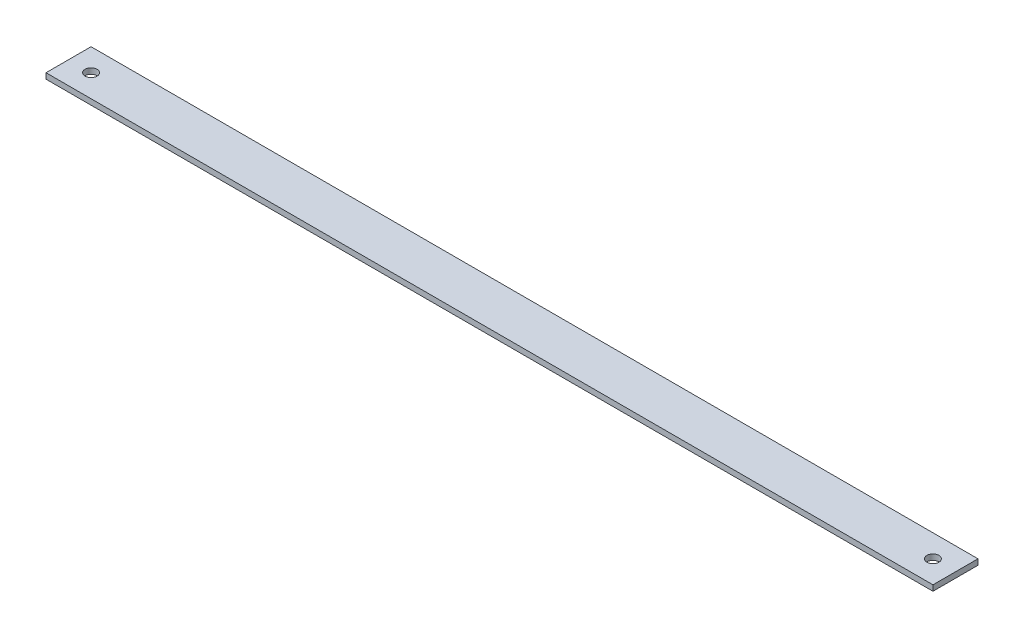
ISO-10303-21;
HEADER;
FILE_DESCRIPTION(('STEP AP214'),'2;1');
FILE_NAME('part.step','',(''),(''),'','','');
FILE_SCHEMA(('AUTOMOTIVE_DESIGN { 1 0 10303 214 1 1 1 1 }'));
ENDSEC;
DATA;
#1=APPLICATION_CONTEXT('core data for automotive mechanical design processes');
#2=APPLICATION_PROTOCOL_DEFINITION('international standard','automotive_design',2000,#1);
#3=PRODUCT_CONTEXT('',#1,'mechanical');
#4=PRODUCT('Part','Part','',(#3));
#5=PRODUCT_RELATED_PRODUCT_CATEGORY('part','',(#4));
#6=PRODUCT_DEFINITION_FORMATION('','',#4);
#7=PRODUCT_DEFINITION_CONTEXT('part definition',#1,'design');
#8=PRODUCT_DEFINITION('design','',#6,#7);
#9=PRODUCT_DEFINITION_SHAPE('','',#8);
#10=(LENGTH_UNIT() NAMED_UNIT(*) SI_UNIT(.MILLI.,.METRE.));
#11=(NAMED_UNIT(*) PLANE_ANGLE_UNIT() SI_UNIT($,.RADIAN.));
#12=(NAMED_UNIT(*) SI_UNIT($,.STERADIAN.) SOLID_ANGLE_UNIT());
#13=UNCERTAINTY_MEASURE_WITH_UNIT(LENGTH_MEASURE(1.E-05),#10,'distance_accuracy_value','');
#14=(GEOMETRIC_REPRESENTATION_CONTEXT(3) GLOBAL_UNCERTAINTY_ASSIGNED_CONTEXT((#13)) GLOBAL_UNIT_ASSIGNED_CONTEXT((#10,
#11,#12)) REPRESENTATION_CONTEXT('',''));
#15=CARTESIAN_POINT('',(0.,0.,0.));
#16=DIRECTION('',(0.,0.,1.));
#17=DIRECTION('',(1.,0.,0.));
#18=AXIS2_PLACEMENT_3D('',#15,#16,#17);
#19=CARTESIAN_POINT('',(250.063,3.175,-12.7));
#20=DIRECTION('',(-1.,0.,0.));
#21=DIRECTION('',(0.,0.,1.));
#22=AXIS2_PLACEMENT_3D('',#19,#20,#21);
#23=PLANE('',#22);
#24=DIRECTION('',(0.,0.,-1.));
#25=VECTOR('',#24,1.);
#26=CARTESIAN_POINT('',(250.063,0.,-12.7));
#27=LINE('',#26,#25);
#28=CARTESIAN_POINT('',(250.063,0.,12.7));
#29=VERTEX_POINT('',#28);
#30=CARTESIAN_POINT('',(250.063,0.,-12.7));
#31=VERTEX_POINT('',#30);
#32=EDGE_CURVE('E97',#29,#31,#27,.T.);
#33=ORIENTED_EDGE('',*,*,#32,.T.);
#34=DIRECTION('',(0.,-1.,0.));
#35=VECTOR('',#34,1.);
#36=CARTESIAN_POINT('',(250.063,3.175,-12.7));
#37=LINE('',#36,#35);
#38=CARTESIAN_POINT('',(250.063,3.175,-12.7));
#39=VERTEX_POINT('',#38);
#40=EDGE_CURVE('E11',#39,#31,#37,.T.);
#41=ORIENTED_EDGE('',*,*,#40,.F.);
#42=DIRECTION('',(0.,0.,-1.));
#43=VECTOR('',#42,1.);
#44=CARTESIAN_POINT('',(250.063,3.175,-12.7));
#45=LINE('',#44,#43);
#46=CARTESIAN_POINT('',(250.063,3.175,12.7));
#47=VERTEX_POINT('',#46);
#48=EDGE_CURVE('E85',#47,#39,#45,.T.);
#49=ORIENTED_EDGE('',*,*,#48,.F.);
#50=DIRECTION('',(0.,-1.,0.));
#51=VECTOR('',#50,1.);
#52=CARTESIAN_POINT('',(250.063,3.175,12.7));
#53=LINE('',#52,#51);
#54=EDGE_CURVE('E93',#47,#29,#53,.T.);
#55=ORIENTED_EDGE('',*,*,#54,.T.);
#56=EDGE_LOOP('',(#33,#41,#49,#55));
#57=FACE_BOUND('',#56,.T.);
#58=ADVANCED_FACE('F34',(#57),#23,.F.);
#59=CARTESIAN_POINT('',(-250.063,3.175,-12.7));
#60=DIRECTION('',(0.,0.,1.));
#61=DIRECTION('',(1.,0.,0.));
#62=AXIS2_PLACEMENT_3D('',#59,#60,#61);
#63=PLANE('',#62);
#64=DIRECTION('',(-1.,0.,0.));
#65=VECTOR('',#64,1.);
#66=CARTESIAN_POINT('',(-250.063,0.,-12.7));
#67=LINE('',#66,#65);
#68=CARTESIAN_POINT('',(-250.063,0.,-12.7));
#69=VERTEX_POINT('',#68);
#70=EDGE_CURVE('E89',#31,#69,#67,.T.);
#71=ORIENTED_EDGE('',*,*,#70,.T.);
#72=DIRECTION('',(0.,-1.,0.));
#73=VECTOR('',#72,1.);
#74=CARTESIAN_POINT('',(-250.063,3.175,-12.7));
#75=LINE('',#74,#73);
#76=CARTESIAN_POINT('',(-250.063,3.175,-12.7));
#77=VERTEX_POINT('',#76);
#78=EDGE_CURVE('E42',#77,#69,#75,.T.);
#79=ORIENTED_EDGE('',*,*,#78,.F.);
#80=DIRECTION('',(-1.,0.,0.));
#81=VECTOR('',#80,1.);
#82=CARTESIAN_POINT('',(-250.063,3.175,-12.7));
#83=LINE('',#82,#81);
#84=EDGE_CURVE('E80',#39,#77,#83,.T.);
#85=ORIENTED_EDGE('',*,*,#84,.F.);
#86=ORIENTED_EDGE('',*,*,#40,.T.);
#87=EDGE_LOOP('',(#71,#79,#85,#86));
#88=FACE_BOUND('',#87,.T.);
#89=ADVANCED_FACE('F88',(#88),#63,.F.);
#90=CARTESIAN_POINT('',(-250.063,3.175,-12.7));
#91=DIRECTION('',(1.,0.,0.));
#92=DIRECTION('',(0.,0.,-1.));
#93=AXIS2_PLACEMENT_3D('',#90,#91,#92);
#94=PLANE('',#93);
#95=DIRECTION('',(0.,0.,1.));
#96=VECTOR('',#95,1.);
#97=CARTESIAN_POINT('',(-250.063,0.,-12.7));
#98=LINE('',#97,#96);
#99=CARTESIAN_POINT('',(-250.063,0.,12.7));
#100=VERTEX_POINT('',#99);
#101=EDGE_CURVE('E67',#69,#100,#98,.T.);
#102=ORIENTED_EDGE('',*,*,#101,.T.);
#103=DIRECTION('',(0.,-1.,0.));
#104=VECTOR('',#103,1.);
#105=CARTESIAN_POINT('',(-250.063,3.175,12.7));
#106=LINE('',#105,#104);
#107=CARTESIAN_POINT('',(-250.063,3.175,12.7));
#108=VERTEX_POINT('',#107);
#109=EDGE_CURVE('E90',#108,#100,#106,.T.);
#110=ORIENTED_EDGE('',*,*,#109,.F.);
#111=DIRECTION('',(0.,0.,1.));
#112=VECTOR('',#111,1.);
#113=CARTESIAN_POINT('',(-250.063,3.175,-12.7));
#114=LINE('',#113,#112);
#115=EDGE_CURVE('E83',#77,#108,#114,.T.);
#116=ORIENTED_EDGE('',*,*,#115,.F.);
#117=ORIENTED_EDGE('',*,*,#78,.T.);
#118=EDGE_LOOP('',(#102,#110,#116,#117));
#119=FACE_BOUND('',#118,.T.);
#120=ADVANCED_FACE('F91',(#119),#94,.F.);
#121=CARTESIAN_POINT('',(-250.063,3.175,12.7));
#122=DIRECTION('',(0.,0.,-1.));
#123=DIRECTION('',(-1.,0.,0.));
#124=AXIS2_PLACEMENT_3D('',#121,#122,#123);
#125=PLANE('',#124);
#126=DIRECTION('',(1.,0.,0.));
#127=VECTOR('',#126,1.);
#128=CARTESIAN_POINT('',(-250.063,0.,12.7));
#129=LINE('',#128,#127);
#130=EDGE_CURVE('E73',#100,#29,#129,.T.);
#131=ORIENTED_EDGE('',*,*,#130,.T.);
#132=ORIENTED_EDGE('',*,*,#54,.F.);
#133=DIRECTION('',(1.,0.,0.));
#134=VECTOR('',#133,1.);
#135=CARTESIAN_POINT('',(-250.063,3.175,12.7));
#136=LINE('',#135,#134);
#137=EDGE_CURVE('E50',#108,#47,#136,.T.);
#138=ORIENTED_EDGE('',*,*,#137,.F.);
#139=ORIENTED_EDGE('',*,*,#109,.T.);
#140=EDGE_LOOP('',(#131,#132,#138,#139));
#141=FACE_BOUND('',#140,.T.);
#142=ADVANCED_FACE('F105',(#141),#125,.F.);
#143=CARTESIAN_POINT('',(250.063,3.175,12.7));
#144=DIRECTION('',(0.,1.,0.));
#145=DIRECTION('',(0.,0.,1.));
#146=AXIS2_PLACEMENT_3D('',#143,#144,#145);
#147=PLANE('',#146);
#148=CARTESIAN_POINT('',(237.363,3.175,0.));
#149=DIRECTION('',(0.,1.,0.));
#150=DIRECTION('',(0.,0.,1.));
#151=AXIS2_PLACEMENT_3D('',#148,#149,#150);
#152=CIRCLE('',#151,3.37819999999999);
#153=CARTESIAN_POINT('',(237.363,3.175,3.37819999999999));
#154=VERTEX_POINT('',#153);
#155=EDGE_CURVE('E117',#154,#154,#152,.T.);
#156=ORIENTED_EDGE('',*,*,#155,.F.);
#157=EDGE_LOOP('',(#156));
#158=FACE_BOUND('',#157,.T.);
#159=CARTESIAN_POINT('',(-237.363,3.175,0.));
#160=DIRECTION('',(0.,1.,0.));
#161=DIRECTION('',(0.,0.,1.));
#162=AXIS2_PLACEMENT_3D('',#159,#160,#161);
#163=CIRCLE('',#162,3.37819999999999);
#164=CARTESIAN_POINT('',(-237.363,3.175,3.37819999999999));
#165=VERTEX_POINT('',#164);
#166=EDGE_CURVE('E111',#165,#165,#163,.T.);
#167=ORIENTED_EDGE('',*,*,#166,.F.);
#168=EDGE_LOOP('',(#167));
#169=FACE_BOUND('',#168,.T.);
#170=ORIENTED_EDGE('',*,*,#48,.T.);
#171=ORIENTED_EDGE('',*,*,#84,.T.);
#172=ORIENTED_EDGE('',*,*,#115,.T.);
#173=ORIENTED_EDGE('',*,*,#137,.T.);
#174=EDGE_LOOP('',(#170,#171,#172,#173));
#175=FACE_BOUND('',#174,.T.);
#176=ADVANCED_FACE('F81',(#158,#169,#175),#147,.T.);
#177=CARTESIAN_POINT('',(250.063,0.,12.7));
#178=DIRECTION('',(0.,1.,0.));
#179=DIRECTION('',(0.,0.,1.));
#180=AXIS2_PLACEMENT_3D('',#177,#178,#179);
#181=PLANE('',#180);
#182=CARTESIAN_POINT('',(237.363,0.,0.));
#183=DIRECTION('',(0.,1.,0.));
#184=DIRECTION('',(0.,0.,1.));
#185=AXIS2_PLACEMENT_3D('',#182,#183,#184);
#186=CIRCLE('',#185,3.37819999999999);
#187=CARTESIAN_POINT('',(237.363,0.,3.37819999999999));
#188=VERTEX_POINT('',#187);
#189=EDGE_CURVE('E114',#188,#188,#186,.T.);
#190=ORIENTED_EDGE('',*,*,#189,.T.);
#191=EDGE_LOOP('',(#190));
#192=FACE_BOUND('',#191,.T.);
#193=CARTESIAN_POINT('',(-237.363,0.,0.));
#194=DIRECTION('',(0.,1.,0.));
#195=DIRECTION('',(0.,0.,1.));
#196=AXIS2_PLACEMENT_3D('',#193,#194,#195);
#197=CIRCLE('',#196,3.37819999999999);
#198=CARTESIAN_POINT('',(-237.363,0.,3.37819999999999));
#199=VERTEX_POINT('',#198);
#200=EDGE_CURVE('E100',#199,#199,#197,.T.);
#201=ORIENTED_EDGE('',*,*,#200,.T.);
#202=EDGE_LOOP('',(#201));
#203=FACE_BOUND('',#202,.T.);
#204=ORIENTED_EDGE('',*,*,#32,.F.);
#205=ORIENTED_EDGE('',*,*,#130,.F.);
#206=ORIENTED_EDGE('',*,*,#101,.F.);
#207=ORIENTED_EDGE('',*,*,#70,.F.);
#208=EDGE_LOOP('',(#204,#205,#206,#207));
#209=FACE_BOUND('',#208,.T.);
#210=ADVANCED_FACE('F108',(#192,#203,#209),#181,.F.);
#211=CARTESIAN_POINT('',(-237.363,0.,0.));
#212=DIRECTION('',(0.,1.,0.));
#213=DIRECTION('',(0.,0.,1.));
#214=AXIS2_PLACEMENT_3D('',#211,#212,#213);
#215=CYLINDRICAL_SURFACE('',#214,3.37819999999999);
#216=ORIENTED_EDGE('',*,*,#200,.F.);
#217=EDGE_LOOP('',(#216));
#218=FACE_BOUND('',#217,.T.);
#219=ORIENTED_EDGE('',*,*,#166,.T.);
#220=EDGE_LOOP('',(#219));
#221=FACE_BOUND('',#220,.T.);
#222=ADVANCED_FACE('F128',(#218,#221),#215,.F.);
#223=CARTESIAN_POINT('',(237.363,0.,0.));
#224=DIRECTION('',(0.,1.,0.));
#225=DIRECTION('',(0.,0.,1.));
#226=AXIS2_PLACEMENT_3D('',#223,#224,#225);
#227=CYLINDRICAL_SURFACE('',#226,3.37819999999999);
#228=ORIENTED_EDGE('',*,*,#189,.F.);
#229=EDGE_LOOP('',(#228));
#230=FACE_BOUND('',#229,.T.);
#231=ORIENTED_EDGE('',*,*,#155,.T.);
#232=EDGE_LOOP('',(#231));
#233=FACE_BOUND('',#232,.T.);
#234=ADVANCED_FACE('F125',(#230,#233),#227,.F.);
#235=CLOSED_SHELL('',(#58,#89,#120,#142,#176,#210,#222,#234));
#236=MANIFOLD_SOLID_BREP('B2',#235);
#237=ADVANCED_BREP_SHAPE_REPRESENTATION('',(#18,#236),#14);
#238=SHAPE_DEFINITION_REPRESENTATION(#9,#237);
ENDSEC;
END-ISO-10303-21;
